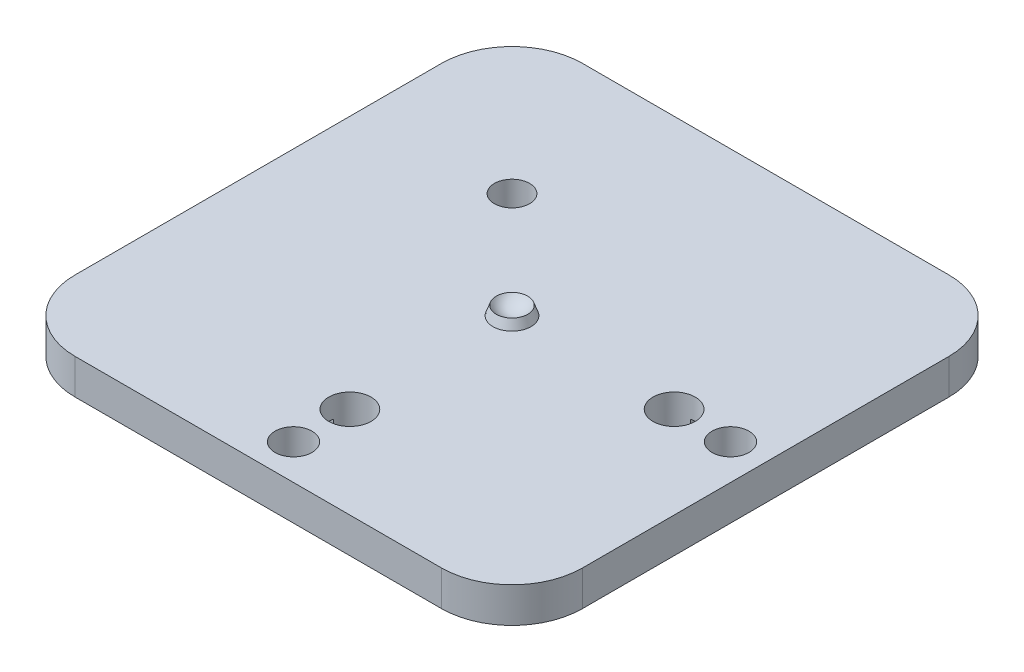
ISO-10303-21;
HEADER;
FILE_DESCRIPTION(('STEP AP214'),'2;1');
FILE_NAME('part.step','',(''),(''),'','','');
FILE_SCHEMA(('AUTOMOTIVE_DESIGN { 1 0 10303 214 1 1 1 1 }'));
ENDSEC;
DATA;
#1=APPLICATION_CONTEXT('core data for automotive mechanical design processes');
#2=APPLICATION_PROTOCOL_DEFINITION('international standard','automotive_design',2000,#1);
#3=PRODUCT_CONTEXT('',#1,'mechanical');
#4=PRODUCT('Part','Part','',(#3));
#5=PRODUCT_RELATED_PRODUCT_CATEGORY('part','',(#4));
#6=PRODUCT_DEFINITION_FORMATION('','',#4);
#7=PRODUCT_DEFINITION_CONTEXT('part definition',#1,'design');
#8=PRODUCT_DEFINITION('design','',#6,#7);
#9=PRODUCT_DEFINITION_SHAPE('','',#8);
#10=(LENGTH_UNIT() NAMED_UNIT(*) SI_UNIT(.MILLI.,.METRE.));
#11=(NAMED_UNIT(*) PLANE_ANGLE_UNIT() SI_UNIT($,.RADIAN.));
#12=(NAMED_UNIT(*) SI_UNIT($,.STERADIAN.) SOLID_ANGLE_UNIT());
#13=UNCERTAINTY_MEASURE_WITH_UNIT(LENGTH_MEASURE(1.E-05),#10,'distance_accuracy_value','');
#14=(GEOMETRIC_REPRESENTATION_CONTEXT(3) GLOBAL_UNCERTAINTY_ASSIGNED_CONTEXT((#13)) GLOBAL_UNIT_ASSIGNED_CONTEXT((#10,
#11,#12)) REPRESENTATION_CONTEXT('',''));
#15=CARTESIAN_POINT('',(0.,0.,0.));
#16=DIRECTION('',(0.,0.,1.));
#17=DIRECTION('',(1.,0.,0.));
#18=AXIS2_PLACEMENT_3D('',#15,#16,#17);
#19=CARTESIAN_POINT('',(0.,0.,0.));
#20=DIRECTION('',(0.,-1.,0.));
#21=DIRECTION('',(0.,0.,-1.));
#22=AXIS2_PLACEMENT_3D('',#19,#20,#21);
#23=CONICAL_SURFACE('',#22,2.7,0.349065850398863);
#24=CARTESIAN_POINT('',(0.,1.28250536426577,0.));
#25=DIRECTION('',(0.,1.,0.));
#26=DIRECTION('',(0.,0.,1.));
#27=AXIS2_PLACEMENT_3D('',#24,#25,#26);
#28=CIRCLE('',#27,2.23320622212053);
#29=CARTESIAN_POINT('',(0.,1.28250536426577,2.23320622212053));
#30=VERTEX_POINT('',#29);
#31=EDGE_CURVE('E421',#30,#30,#28,.T.);
#32=ORIENTED_EDGE('',*,*,#31,.F.);
#33=EDGE_LOOP('',(#32));
#34=FACE_BOUND('',#33,.T.);
#35=CARTESIAN_POINT('',(0.,0.,0.));
#36=DIRECTION('',(0.,1.,0.));
#37=DIRECTION('',(0.,0.,1.));
#38=AXIS2_PLACEMENT_3D('',#35,#36,#37);
#39=CIRCLE('',#38,2.7);
#40=CARTESIAN_POINT('',(0.,0.,2.7));
#41=VERTEX_POINT('',#40);
#42=EDGE_CURVE('E411',#41,#41,#39,.T.);
#43=ORIENTED_EDGE('',*,*,#42,.T.);
#44=EDGE_LOOP('',(#43));
#45=FACE_BOUND('',#44,.T.);
#46=ADVANCED_FACE('F41',(#34,#45),#23,.T.);
#47=CARTESIAN_POINT('',(0.,2.8,0.));
#48=DIRECTION('',(0.,1.,0.));
#49=DIRECTION('',(1.,0.,0.));
#50=AXIS2_PLACEMENT_3D('',#47,#48,#49);
#51=SPHERICAL_SURFACE('',#50,2.7);
#52=ORIENTED_EDGE('',*,*,#31,.T.);
#53=EDGE_LOOP('',(#52));
#54=FACE_BOUND('',#53,.T.);
#55=ADVANCED_FACE('F534',(#54),#51,.F.);
#56=CARTESIAN_POINT('',(0.,-5.,0.));
#57=DIRECTION('',(0.,1.,0.));
#58=DIRECTION('',(0.,0.,1.));
#59=AXIS2_PLACEMENT_3D('',#56,#57,#58);
#60=PLANE('',#59);
#61=DIRECTION('',(0.,0.,-1.));
#62=VECTOR('',#61,1.);
#63=CARTESIAN_POINT('',(-36.,-5.,-36.));
#64=LINE('',#63,#62);
#65=CARTESIAN_POINT('',(-36.,-5.,26.));
#66=VERTEX_POINT('',#65);
#67=CARTESIAN_POINT('',(-36.,-5.,-26.));
#68=VERTEX_POINT('',#67);
#69=EDGE_CURVE('E405',#66,#68,#64,.T.);
#70=ORIENTED_EDGE('',*,*,#69,.T.);
#71=CARTESIAN_POINT('',(-26.,-5.,-26.));
#72=DIRECTION('',(0.,1.,0.));
#73=DIRECTION('',(0.,0.,1.));
#74=AXIS2_PLACEMENT_3D('',#71,#72,#73);
#75=CIRCLE('',#74,10.);
#76=CARTESIAN_POINT('',(-26.,-5.,-36.));
#77=VERTEX_POINT('',#76);
#78=EDGE_CURVE('E486',#68,#77,#75,.F.);
#79=ORIENTED_EDGE('',*,*,#78,.T.);
#80=DIRECTION('',(1.,0.,0.));
#81=VECTOR('',#80,1.);
#82=CARTESIAN_POINT('',(-36.,-5.,-36.));
#83=LINE('',#82,#81);
#84=CARTESIAN_POINT('',(26.,-5.,-36.));
#85=VERTEX_POINT('',#84);
#86=EDGE_CURVE('E408',#77,#85,#83,.T.);
#87=ORIENTED_EDGE('',*,*,#86,.T.);
#88=CARTESIAN_POINT('',(26.,-5.,-26.));
#89=DIRECTION('',(0.,1.,0.));
#90=DIRECTION('',(0.,0.,1.));
#91=AXIS2_PLACEMENT_3D('',#88,#89,#90);
#92=CIRCLE('',#91,10.);
#93=CARTESIAN_POINT('',(36.,-5.,-26.));
#94=VERTEX_POINT('',#93);
#95=EDGE_CURVE('E484',#85,#94,#92,.F.);
#96=ORIENTED_EDGE('',*,*,#95,.T.);
#97=DIRECTION('',(0.,0.,1.));
#98=VECTOR('',#97,1.);
#99=CARTESIAN_POINT('',(36.,-5.,-36.));
#100=LINE('',#99,#98);
#101=CARTESIAN_POINT('',(36.,-5.,26.));
#102=VERTEX_POINT('',#101);
#103=EDGE_CURVE('E400',#94,#102,#100,.T.);
#104=ORIENTED_EDGE('',*,*,#103,.T.);
#105=CARTESIAN_POINT('',(26.,-5.,26.));
#106=DIRECTION('',(0.,1.,0.));
#107=DIRECTION('',(0.,0.,1.));
#108=AXIS2_PLACEMENT_3D('',#105,#106,#107);
#109=CIRCLE('',#108,10.);
#110=CARTESIAN_POINT('',(26.,-5.,36.));
#111=VERTEX_POINT('',#110);
#112=EDGE_CURVE('E61',#102,#111,#109,.F.);
#113=ORIENTED_EDGE('',*,*,#112,.T.);
#114=DIRECTION('',(-1.,0.,0.));
#115=VECTOR('',#114,1.);
#116=CARTESIAN_POINT('',(-36.,-5.,36.));
#117=LINE('',#116,#115);
#118=CARTESIAN_POINT('',(-26.,-5.,36.));
#119=VERTEX_POINT('',#118);
#120=EDGE_CURVE('E402',#111,#119,#117,.T.);
#121=ORIENTED_EDGE('',*,*,#120,.T.);
#122=CARTESIAN_POINT('',(-26.,-5.,26.));
#123=DIRECTION('',(0.,1.,0.));
#124=DIRECTION('',(0.,0.,1.));
#125=AXIS2_PLACEMENT_3D('',#122,#123,#124);
#126=CIRCLE('',#125,10.);
#127=EDGE_CURVE('E482',#119,#66,#126,.F.);
#128=ORIENTED_EDGE('',*,*,#127,.T.);
#129=EDGE_LOOP('',(#70,#79,#87,#96,#104,#113,#121,#128));
#130=FACE_BOUND('',#129,.T.);
#131=CARTESIAN_POINT('',(23.,-5.,0.));
#132=DIRECTION('',(0.,-1.,0.));
#133=DIRECTION('',(0.,0.,-1.));
#134=AXIS2_PLACEMENT_3D('',#131,#132,#133);
#135=CIRCLE('',#134,3.);
#136=CARTESIAN_POINT('',(22.4,-5.,2.93938769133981));
#137=VERTEX_POINT('',#136);
#138=CARTESIAN_POINT('',(22.4,-5.,-2.93938769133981));
#139=VERTEX_POINT('',#138);
#140=EDGE_CURVE('E396',#137,#139,#135,.T.);
#141=ORIENTED_EDGE('',*,*,#140,.F.);
#142=DIRECTION('',(0.,0.,-1.));
#143=VECTOR('',#142,1.);
#144=CARTESIAN_POINT('',(22.4,-5.,-5.3));
#145=LINE('',#144,#143);
#146=CARTESIAN_POINT('',(22.4,-5.,5.3));
#147=VERTEX_POINT('',#146);
#148=EDGE_CURVE('E287',#147,#137,#145,.T.);
#149=ORIENTED_EDGE('',*,*,#148,.F.);
#150=DIRECTION('',(-1.,0.,0.));
#151=VECTOR('',#150,1.);
#152=CARTESIAN_POINT('',(22.4,-5.,5.3));
#153=LINE('',#152,#151);
#154=CARTESIAN_POINT('',(23.6,-5.,5.3));
#155=VERTEX_POINT('',#154);
#156=EDGE_CURVE('E312',#155,#147,#153,.T.);
#157=ORIENTED_EDGE('',*,*,#156,.F.);
#158=DIRECTION('',(0.,0.,1.));
#159=VECTOR('',#158,1.);
#160=CARTESIAN_POINT('',(23.6,-5.,5.3));
#161=LINE('',#160,#159);
#162=CARTESIAN_POINT('',(23.6,-5.,2.93938769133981));
#163=VERTEX_POINT('',#162);
#164=EDGE_CURVE('E315',#163,#155,#161,.T.);
#165=ORIENTED_EDGE('',*,*,#164,.F.);
#166=CARTESIAN_POINT('',(23.6,-5.,-2.93938769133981));
#167=VERTEX_POINT('',#166);
#168=EDGE_CURVE('E392',#167,#163,#135,.T.);
#169=ORIENTED_EDGE('',*,*,#168,.F.);
#170=CARTESIAN_POINT('',(23.6,-5.,-5.3));
#171=VERTEX_POINT('',#170);
#172=EDGE_CURVE('E317',#171,#167,#161,.T.);
#173=ORIENTED_EDGE('',*,*,#172,.F.);
#174=DIRECTION('',(1.,0.,0.));
#175=VECTOR('',#174,1.);
#176=CARTESIAN_POINT('',(23.6,-5.,-5.3));
#177=LINE('',#176,#175);
#178=CARTESIAN_POINT('',(22.4,-5.,-5.3));
#179=VERTEX_POINT('',#178);
#180=EDGE_CURVE('E319',#179,#171,#177,.T.);
#181=ORIENTED_EDGE('',*,*,#180,.F.);
#182=EDGE_CURVE('E322',#139,#179,#145,.T.);
#183=ORIENTED_EDGE('',*,*,#182,.F.);
#184=EDGE_LOOP('',(#141,#149,#157,#165,#169,#173,#181,#183));
#185=FACE_BOUND('',#184,.T.);
#186=CARTESIAN_POINT('',(0.,-5.,23.));
#187=DIRECTION('',(0.,-1.,0.));
#188=DIRECTION('',(0.,0.,-1.));
#189=AXIS2_PLACEMENT_3D('',#186,#187,#188);
#190=CIRCLE('',#189,3.);
#191=CARTESIAN_POINT('',(2.93938769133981,-5.,23.6));
#192=VERTEX_POINT('',#191);
#193=CARTESIAN_POINT('',(-2.93938769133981,-5.,23.6));
#194=VERTEX_POINT('',#193);
#195=EDGE_CURVE('E388',#192,#194,#190,.T.);
#196=ORIENTED_EDGE('',*,*,#195,.F.);
#197=DIRECTION('',(-1.,0.,0.));
#198=VECTOR('',#197,1.);
#199=CARTESIAN_POINT('',(-5.3,-5.,23.6));
#200=LINE('',#199,#198);
#201=CARTESIAN_POINT('',(5.3,-5.,23.6));
#202=VERTEX_POINT('',#201);
#203=EDGE_CURVE('E277',#202,#192,#200,.T.);
#204=ORIENTED_EDGE('',*,*,#203,.F.);
#205=DIRECTION('',(0.,0.,1.));
#206=VECTOR('',#205,1.);
#207=CARTESIAN_POINT('',(5.3,-5.,23.6));
#208=LINE('',#207,#206);
#209=CARTESIAN_POINT('',(5.3,-5.,22.4));
#210=VERTEX_POINT('',#209);
#211=EDGE_CURVE('E290',#210,#202,#208,.T.);
#212=ORIENTED_EDGE('',*,*,#211,.F.);
#213=DIRECTION('',(1.,0.,0.));
#214=VECTOR('',#213,1.);
#215=CARTESIAN_POINT('',(5.3,-5.,22.4));
#216=LINE('',#215,#214);
#217=CARTESIAN_POINT('',(2.93938769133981,-5.,22.4));
#218=VERTEX_POINT('',#217);
#219=EDGE_CURVE('E286',#218,#210,#216,.T.);
#220=ORIENTED_EDGE('',*,*,#219,.F.);
#221=CARTESIAN_POINT('',(-2.93938769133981,-5.,22.4));
#222=VERTEX_POINT('',#221);
#223=EDGE_CURVE('E385',#222,#218,#190,.T.);
#224=ORIENTED_EDGE('',*,*,#223,.F.);
#225=CARTESIAN_POINT('',(-5.3,-5.,22.4));
#226=VERTEX_POINT('',#225);
#227=EDGE_CURVE('E288',#226,#222,#216,.T.);
#228=ORIENTED_EDGE('',*,*,#227,.F.);
#229=DIRECTION('',(0.,0.,-1.));
#230=VECTOR('',#229,1.);
#231=CARTESIAN_POINT('',(-5.3,-5.,22.4));
#232=LINE('',#231,#230);
#233=CARTESIAN_POINT('',(-5.3,-5.,23.6));
#234=VERTEX_POINT('',#233);
#235=EDGE_CURVE('E257',#234,#226,#232,.T.);
#236=ORIENTED_EDGE('',*,*,#235,.F.);
#237=EDGE_CURVE('E279',#194,#234,#200,.T.);
#238=ORIENTED_EDGE('',*,*,#237,.F.);
#239=EDGE_LOOP('',(#196,#204,#212,#220,#224,#228,#236,#238));
#240=FACE_BOUND('',#239,.T.);
#241=CARTESIAN_POINT('',(-15.,-5.,-15.));
#242=DIRECTION('',(0.,-1.,0.));
#243=DIRECTION('',(0.,0.,-1.));
#244=AXIS2_PLACEMENT_3D('',#241,#242,#243);
#245=CIRCLE('',#244,2.5);
#246=CARTESIAN_POINT('',(-12.859635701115,-5.,-16.2918361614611));
#247=VERTEX_POINT('',#246);
#248=CARTESIAN_POINT('',(-16.2918361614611,-5.,-12.859635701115));
#249=VERTEX_POINT('',#248);
#250=EDGE_CURVE('E382',#247,#249,#245,.T.);
#251=ORIENTED_EDGE('',*,*,#250,.F.);
#252=DIRECTION('',(-0.707106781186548,0.,0.707106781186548));
#253=VECTOR('',#252,1.);
#254=CARTESIAN_POINT('',(-18.3234018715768,-5.,-10.8280699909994));
#255=LINE('',#254,#253);
#256=CARTESIAN_POINT('',(-10.8280699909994,-5.,-18.3234018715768));
#257=VERTEX_POINT('',#256);
#258=EDGE_CURVE('E345',#257,#247,#255,.T.);
#259=ORIENTED_EDGE('',*,*,#258,.F.);
#260=DIRECTION('',(0.707106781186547,0.,0.707106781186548));
#261=VECTOR('',#260,1.);
#262=CARTESIAN_POINT('',(-10.8280699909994,-5.,-18.3234018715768));
#263=LINE('',#262,#261);
#264=CARTESIAN_POINT('',(-11.6765981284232,-5.,-19.1719300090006));
#265=VERTEX_POINT('',#264);
#266=EDGE_CURVE('E347',#265,#257,#263,.T.);
#267=ORIENTED_EDGE('',*,*,#266,.F.);
#268=DIRECTION('',(0.707106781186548,0.,-0.707106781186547));
#269=VECTOR('',#268,1.);
#270=CARTESIAN_POINT('',(-11.6765981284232,-5.,-19.1719300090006));
#271=LINE('',#270,#269);
#272=CARTESIAN_POINT('',(-13.7081638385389,-5.,-17.140364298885));
#273=VERTEX_POINT('',#272);
#274=EDGE_CURVE('E351',#273,#265,#271,.T.);
#275=ORIENTED_EDGE('',*,*,#274,.F.);
#276=CARTESIAN_POINT('',(-17.140364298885,-5.,-13.7081638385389));
#277=VERTEX_POINT('',#276);
#278=EDGE_CURVE('E379',#277,#273,#245,.T.);
#279=ORIENTED_EDGE('',*,*,#278,.F.);
#280=CARTESIAN_POINT('',(-19.1719300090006,-5.,-11.6765981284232));
#281=VERTEX_POINT('',#280);
#282=EDGE_CURVE('E352',#281,#277,#271,.T.);
#283=ORIENTED_EDGE('',*,*,#282,.F.);
#284=DIRECTION('',(-0.707106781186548,0.,-0.707106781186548));
#285=VECTOR('',#284,1.);
#286=CARTESIAN_POINT('',(-19.1719300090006,-5.,-11.6765981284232));
#287=LINE('',#286,#285);
#288=CARTESIAN_POINT('',(-18.3234018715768,-5.,-10.8280699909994));
#289=VERTEX_POINT('',#288);
#290=EDGE_CURVE('E311',#289,#281,#287,.T.);
#291=ORIENTED_EDGE('',*,*,#290,.F.);
#292=EDGE_CURVE('E348',#249,#289,#255,.T.);
#293=ORIENTED_EDGE('',*,*,#292,.F.);
#294=EDGE_LOOP('',(#251,#259,#267,#275,#279,#283,#291,#293));
#295=FACE_BOUND('',#294,.T.);
#296=CARTESIAN_POINT('',(0.,-5.,31.));
#297=DIRECTION('',(0.,-1.,0.));
#298=DIRECTION('',(0.,0.,-1.));
#299=AXIS2_PLACEMENT_3D('',#296,#297,#298);
#300=CIRCLE('',#299,2.625);
#301=CARTESIAN_POINT('',(0.,-5.,28.375));
#302=VERTEX_POINT('',#301);
#303=EDGE_CURVE('E373',#302,#302,#300,.T.);
#304=ORIENTED_EDGE('',*,*,#303,.F.);
#305=EDGE_LOOP('',(#304));
#306=FACE_BOUND('',#305,.T.);
#307=CARTESIAN_POINT('',(31.,-5.,0.));
#308=DIRECTION('',(0.,-1.,0.));
#309=DIRECTION('',(0.,0.,-1.));
#310=AXIS2_PLACEMENT_3D('',#307,#308,#309);
#311=CIRCLE('',#310,2.625);
#312=CARTESIAN_POINT('',(31.,-5.,-2.625));
#313=VERTEX_POINT('',#312);
#314=EDGE_CURVE('E367',#313,#313,#311,.T.);
#315=ORIENTED_EDGE('',*,*,#314,.F.);
#316=EDGE_LOOP('',(#315));
#317=FACE_BOUND('',#316,.T.);
#318=ADVANCED_FACE('F512',(#130,#185,#240,#295,#306,#317),#60,.F.);
#319=CARTESIAN_POINT('',(0.,0.,0.));
#320=DIRECTION('',(0.,1.,0.));
#321=DIRECTION('',(0.,0.,1.));
#322=AXIS2_PLACEMENT_3D('',#319,#320,#321);
#323=PLANE('',#322);
#324=ORIENTED_EDGE('',*,*,#42,.F.);
#325=EDGE_LOOP('',(#324));
#326=FACE_BOUND('',#325,.T.);
#327=CARTESIAN_POINT('',(0.,0.,31.));
#328=DIRECTION('',(0.,-1.,0.));
#329=DIRECTION('',(0.,0.,-1.));
#330=AXIS2_PLACEMENT_3D('',#327,#328,#329);
#331=CIRCLE('',#330,2.625);
#332=CARTESIAN_POINT('',(0.,0.,28.375));
#333=VERTEX_POINT('',#332);
#334=EDGE_CURVE('E370',#333,#333,#331,.T.);
#335=ORIENTED_EDGE('',*,*,#334,.T.);
#336=EDGE_LOOP('',(#335));
#337=FACE_BOUND('',#336,.T.);
#338=CARTESIAN_POINT('',(0.,0.,23.));
#339=DIRECTION('',(0.,-1.,0.));
#340=DIRECTION('',(0.,0.,-1.));
#341=AXIS2_PLACEMENT_3D('',#338,#339,#340);
#342=CIRCLE('',#341,3.);
#343=CARTESIAN_POINT('',(0.,0.,20.));
#344=VERTEX_POINT('',#343);
#345=EDGE_CURVE('E389',#344,#344,#342,.T.);
#346=ORIENTED_EDGE('',*,*,#345,.T.);
#347=EDGE_LOOP('',(#346));
#348=FACE_BOUND('',#347,.T.);
#349=DIRECTION('',(1.,0.,0.));
#350=VECTOR('',#349,1.);
#351=CARTESIAN_POINT('',(-36.,0.,-36.));
#352=LINE('',#351,#350);
#353=CARTESIAN_POINT('',(-26.,0.,-36.));
#354=VERTEX_POINT('',#353);
#355=CARTESIAN_POINT('',(26.,0.,-36.));
#356=VERTEX_POINT('',#355);
#357=EDGE_CURVE('E403',#354,#356,#352,.T.);
#358=ORIENTED_EDGE('',*,*,#357,.F.);
#359=CARTESIAN_POINT('',(-26.,0.,-26.));
#360=DIRECTION('',(0.,1.,0.));
#361=DIRECTION('',(0.,0.,1.));
#362=AXIS2_PLACEMENT_3D('',#359,#360,#361);
#363=CIRCLE('',#362,10.);
#364=CARTESIAN_POINT('',(-36.,0.,-26.));
#365=VERTEX_POINT('',#364);
#366=EDGE_CURVE('E474',#354,#365,#363,.T.);
#367=ORIENTED_EDGE('',*,*,#366,.T.);
#368=DIRECTION('',(0.,0.,-1.));
#369=VECTOR('',#368,1.);
#370=CARTESIAN_POINT('',(-36.,0.,-36.));
#371=LINE('',#370,#369);
#372=CARTESIAN_POINT('',(-36.,0.,26.));
#373=VERTEX_POINT('',#372);
#374=EDGE_CURVE('E416',#373,#365,#371,.T.);
#375=ORIENTED_EDGE('',*,*,#374,.F.);
#376=CARTESIAN_POINT('',(-26.,0.,26.));
#377=DIRECTION('',(0.,1.,0.));
#378=DIRECTION('',(0.,0.,1.));
#379=AXIS2_PLACEMENT_3D('',#376,#377,#378);
#380=CIRCLE('',#379,10.);
#381=CARTESIAN_POINT('',(-26.,0.,36.));
#382=VERTEX_POINT('',#381);
#383=EDGE_CURVE('E470',#373,#382,#380,.T.);
#384=ORIENTED_EDGE('',*,*,#383,.T.);
#385=DIRECTION('',(-1.,0.,0.));
#386=VECTOR('',#385,1.);
#387=CARTESIAN_POINT('',(-36.,0.,36.));
#388=LINE('',#387,#386);
#389=CARTESIAN_POINT('',(26.,0.,36.));
#390=VERTEX_POINT('',#389);
#391=EDGE_CURVE('E414',#390,#382,#388,.T.);
#392=ORIENTED_EDGE('',*,*,#391,.F.);
#393=CARTESIAN_POINT('',(26.,0.,26.));
#394=DIRECTION('',(0.,1.,0.));
#395=DIRECTION('',(0.,0.,1.));
#396=AXIS2_PLACEMENT_3D('',#393,#394,#395);
#397=CIRCLE('',#396,10.);
#398=CARTESIAN_POINT('',(36.,0.,26.));
#399=VERTEX_POINT('',#398);
#400=EDGE_CURVE('E468',#390,#399,#397,.T.);
#401=ORIENTED_EDGE('',*,*,#400,.T.);
#402=DIRECTION('',(0.,0.,1.));
#403=VECTOR('',#402,1.);
#404=CARTESIAN_POINT('',(36.,0.,-36.));
#405=LINE('',#404,#403);
#406=CARTESIAN_POINT('',(36.,0.,-26.));
#407=VERTEX_POINT('',#406);
#408=EDGE_CURVE('E395',#407,#399,#405,.T.);
#409=ORIENTED_EDGE('',*,*,#408,.F.);
#410=CARTESIAN_POINT('',(26.,0.,-26.));
#411=DIRECTION('',(0.,1.,0.));
#412=DIRECTION('',(0.,0.,1.));
#413=AXIS2_PLACEMENT_3D('',#410,#411,#412);
#414=CIRCLE('',#413,10.);
#415=EDGE_CURVE('E472',#407,#356,#414,.T.);
#416=ORIENTED_EDGE('',*,*,#415,.T.);
#417=EDGE_LOOP('',(#358,#367,#375,#384,#392,#401,#409,#416));
#418=FACE_BOUND('',#417,.T.);
#419=CARTESIAN_POINT('',(23.,0.,0.));
#420=DIRECTION('',(0.,-1.,0.));
#421=DIRECTION('',(0.,0.,-1.));
#422=AXIS2_PLACEMENT_3D('',#419,#420,#421);
#423=CIRCLE('',#422,3.);
#424=CARTESIAN_POINT('',(23.,0.,-3.));
#425=VERTEX_POINT('',#424);
#426=EDGE_CURVE('E397',#425,#425,#423,.T.);
#427=ORIENTED_EDGE('',*,*,#426,.T.);
#428=EDGE_LOOP('',(#427));
#429=FACE_BOUND('',#428,.T.);
#430=CARTESIAN_POINT('',(-15.,0.,-15.));
#431=DIRECTION('',(0.,-1.,0.));
#432=DIRECTION('',(0.,0.,-1.));
#433=AXIS2_PLACEMENT_3D('',#430,#431,#432);
#434=CIRCLE('',#433,2.5);
#435=CARTESIAN_POINT('',(-15.,0.,-17.5));
#436=VERTEX_POINT('',#435);
#437=EDGE_CURVE('E376',#436,#436,#434,.T.);
#438=ORIENTED_EDGE('',*,*,#437,.T.);
#439=EDGE_LOOP('',(#438));
#440=FACE_BOUND('',#439,.T.);
#441=CARTESIAN_POINT('',(31.,0.,0.));
#442=DIRECTION('',(0.,-1.,0.));
#443=DIRECTION('',(0.,0.,-1.));
#444=AXIS2_PLACEMENT_3D('',#441,#442,#443);
#445=CIRCLE('',#444,2.625);
#446=CARTESIAN_POINT('',(31.,0.,-2.625));
#447=VERTEX_POINT('',#446);
#448=EDGE_CURVE('E295',#447,#447,#445,.T.);
#449=ORIENTED_EDGE('',*,*,#448,.T.);
#450=EDGE_LOOP('',(#449));
#451=FACE_BOUND('',#450,.T.);
#452=ADVANCED_FACE('F499',(#326,#337,#348,#418,#429,#440,#451),#323,.T.);
#453=CARTESIAN_POINT('',(36.,-5.,-36.));
#454=DIRECTION('',(-1.,0.,0.));
#455=DIRECTION('',(0.,0.,1.));
#456=AXIS2_PLACEMENT_3D('',#453,#454,#455);
#457=PLANE('',#456);
#458=ORIENTED_EDGE('',*,*,#103,.F.);
#459=DIRECTION('',(0.,1.,0.));
#460=VECTOR('',#459,1.);
#461=CARTESIAN_POINT('',(36.,-5.,-26.));
#462=LINE('',#461,#460);
#463=EDGE_CURVE('E490',#94,#407,#462,.T.);
#464=ORIENTED_EDGE('',*,*,#463,.T.);
#465=ORIENTED_EDGE('',*,*,#408,.T.);
#466=DIRECTION('',(0.,1.,0.));
#467=VECTOR('',#466,1.);
#468=CARTESIAN_POINT('',(36.,-5.,26.));
#469=LINE('',#468,#467);
#470=EDGE_CURVE('E488',#399,#102,#469,.F.);
#471=ORIENTED_EDGE('',*,*,#470,.T.);
#472=EDGE_LOOP('',(#458,#464,#465,#471));
#473=FACE_BOUND('',#472,.T.);
#474=ADVANCED_FACE('F527',(#473),#457,.F.);
#475=CARTESIAN_POINT('',(-36.,-5.,36.));
#476=DIRECTION('',(0.,0.,-1.));
#477=DIRECTION('',(-1.,0.,0.));
#478=AXIS2_PLACEMENT_3D('',#475,#476,#477);
#479=PLANE('',#478);
#480=ORIENTED_EDGE('',*,*,#391,.T.);
#481=DIRECTION('',(0.,1.,0.));
#482=VECTOR('',#481,1.);
#483=CARTESIAN_POINT('',(-26.,-5.,36.));
#484=LINE('',#483,#482);
#485=EDGE_CURVE('E11',#382,#119,#484,.F.);
#486=ORIENTED_EDGE('',*,*,#485,.T.);
#487=ORIENTED_EDGE('',*,*,#120,.F.);
#488=DIRECTION('',(0.,1.,0.));
#489=VECTOR('',#488,1.);
#490=CARTESIAN_POINT('',(26.,-5.,36.));
#491=LINE('',#490,#489);
#492=EDGE_CURVE('E49',#111,#390,#491,.T.);
#493=ORIENTED_EDGE('',*,*,#492,.T.);
#494=EDGE_LOOP('',(#480,#486,#487,#493));
#495=FACE_BOUND('',#494,.T.);
#496=ADVANCED_FACE('F495',(#495),#479,.F.);
#497=CARTESIAN_POINT('',(-36.,-5.,-36.));
#498=DIRECTION('',(1.,0.,0.));
#499=DIRECTION('',(0.,0.,-1.));
#500=AXIS2_PLACEMENT_3D('',#497,#498,#499);
#501=PLANE('',#500);
#502=ORIENTED_EDGE('',*,*,#374,.T.);
#503=DIRECTION('',(0.,1.,0.));
#504=VECTOR('',#503,1.);
#505=CARTESIAN_POINT('',(-36.,-5.,-26.));
#506=LINE('',#505,#504);
#507=EDGE_CURVE('E479',#365,#68,#506,.F.);
#508=ORIENTED_EDGE('',*,*,#507,.T.);
#509=ORIENTED_EDGE('',*,*,#69,.F.);
#510=DIRECTION('',(0.,1.,0.));
#511=VECTOR('',#510,1.);
#512=CARTESIAN_POINT('',(-36.,-5.,26.));
#513=LINE('',#512,#511);
#514=EDGE_CURVE('E476',#66,#373,#513,.T.);
#515=ORIENTED_EDGE('',*,*,#514,.T.);
#516=EDGE_LOOP('',(#502,#508,#509,#515));
#517=FACE_BOUND('',#516,.T.);
#518=ADVANCED_FACE('F509',(#517),#501,.F.);
#519=CARTESIAN_POINT('',(-36.,-5.,-36.));
#520=DIRECTION('',(0.,0.,1.));
#521=DIRECTION('',(1.,0.,0.));
#522=AXIS2_PLACEMENT_3D('',#519,#520,#521);
#523=PLANE('',#522);
#524=ORIENTED_EDGE('',*,*,#86,.F.);
#525=DIRECTION('',(0.,1.,0.));
#526=VECTOR('',#525,1.);
#527=CARTESIAN_POINT('',(-26.,-5.,-36.));
#528=LINE('',#527,#526);
#529=EDGE_CURVE('E465',#77,#354,#528,.T.);
#530=ORIENTED_EDGE('',*,*,#529,.T.);
#531=ORIENTED_EDGE('',*,*,#357,.T.);
#532=DIRECTION('',(0.,1.,0.));
#533=VECTOR('',#532,1.);
#534=CARTESIAN_POINT('',(26.,-5.,-36.));
#535=LINE('',#534,#533);
#536=EDGE_CURVE('E463',#356,#85,#535,.F.);
#537=ORIENTED_EDGE('',*,*,#536,.T.);
#538=EDGE_LOOP('',(#524,#530,#531,#537));
#539=FACE_BOUND('',#538,.T.);
#540=ADVANCED_FACE('F519',(#539),#523,.F.);
#541=CARTESIAN_POINT('',(23.,-5.,0.));
#542=DIRECTION('',(0.,1.,0.));
#543=DIRECTION('',(0.,0.,1.));
#544=AXIS2_PLACEMENT_3D('',#541,#542,#543);
#545=CYLINDRICAL_SURFACE('',#544,3.);
#546=DIRECTION('',(0.,1.,0.));
#547=VECTOR('',#546,1.);
#548=CARTESIAN_POINT('',(22.4,-5.,-2.93938769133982));
#549=LINE('',#548,#547);
#550=CARTESIAN_POINT('',(22.4,-3.,-2.93938769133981));
#551=VERTEX_POINT('',#550);
#552=EDGE_CURVE('E461',#551,#139,#549,.F.);
#553=ORIENTED_EDGE('',*,*,#552,.F.);
#554=CARTESIAN_POINT('',(23.,-3.,0.));
#555=DIRECTION('',(0.,1.,0.));
#556=DIRECTION('',(0.,0.,1.));
#557=AXIS2_PLACEMENT_3D('',#554,#555,#556);
#558=CIRCLE('',#557,3.);
#559=CARTESIAN_POINT('',(23.6,-3.,-2.93938769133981));
#560=VERTEX_POINT('',#559);
#561=EDGE_CURVE('E453',#560,#551,#558,.T.);
#562=ORIENTED_EDGE('',*,*,#561,.F.);
#563=DIRECTION('',(0.,1.,0.));
#564=VECTOR('',#563,1.);
#565=CARTESIAN_POINT('',(23.6,-5.,-2.93938769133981));
#566=LINE('',#565,#564);
#567=EDGE_CURVE('E458',#167,#560,#566,.T.);
#568=ORIENTED_EDGE('',*,*,#567,.F.);
#569=ORIENTED_EDGE('',*,*,#168,.T.);
#570=DIRECTION('',(0.,1.,0.));
#571=VECTOR('',#570,1.);
#572=CARTESIAN_POINT('',(23.6,-5.,2.93938769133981));
#573=LINE('',#572,#571);
#574=CARTESIAN_POINT('',(23.6,-3.,2.93938769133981));
#575=VERTEX_POINT('',#574);
#576=EDGE_CURVE('E452',#575,#163,#573,.F.);
#577=ORIENTED_EDGE('',*,*,#576,.F.);
#578=CARTESIAN_POINT('',(22.4,-3.,2.93938769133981));
#579=VERTEX_POINT('',#578);
#580=EDGE_CURVE('E450',#579,#575,#558,.T.);
#581=ORIENTED_EDGE('',*,*,#580,.F.);
#582=DIRECTION('',(0.,1.,0.));
#583=VECTOR('',#582,1.);
#584=CARTESIAN_POINT('',(22.4,-5.,2.93938769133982));
#585=LINE('',#584,#583);
#586=EDGE_CURVE('E455',#137,#579,#585,.T.);
#587=ORIENTED_EDGE('',*,*,#586,.F.);
#588=ORIENTED_EDGE('',*,*,#140,.T.);
#589=EDGE_LOOP('',(#553,#562,#568,#569,#577,#581,#587,#588));
#590=FACE_BOUND('',#589,.T.);
#591=ORIENTED_EDGE('',*,*,#426,.F.);
#592=EDGE_LOOP('',(#591));
#593=FACE_BOUND('',#592,.T.);
#594=ADVANCED_FACE('F806',(#590,#593),#545,.F.);
#595=CARTESIAN_POINT('',(0.,-5.,23.));
#596=DIRECTION('',(0.,1.,0.));
#597=DIRECTION('',(0.,0.,1.));
#598=AXIS2_PLACEMENT_3D('',#595,#596,#597);
#599=CYLINDRICAL_SURFACE('',#598,3.);
#600=DIRECTION('',(0.,1.,0.));
#601=VECTOR('',#600,1.);
#602=CARTESIAN_POINT('',(2.93938769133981,-5.,23.6));
#603=LINE('',#602,#601);
#604=CARTESIAN_POINT('',(2.93938769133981,-3.,23.6));
#605=VERTEX_POINT('',#604);
#606=EDGE_CURVE('E447',#192,#605,#603,.T.);
#607=ORIENTED_EDGE('',*,*,#606,.F.);
#608=ORIENTED_EDGE('',*,*,#195,.T.);
#609=DIRECTION('',(0.,1.,0.));
#610=VECTOR('',#609,1.);
#611=CARTESIAN_POINT('',(-2.93938769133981,-5.,23.6));
#612=LINE('',#611,#610);
#613=CARTESIAN_POINT('',(-2.93938769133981,-3.,23.6));
#614=VERTEX_POINT('',#613);
#615=EDGE_CURVE('E443',#614,#194,#612,.F.);
#616=ORIENTED_EDGE('',*,*,#615,.F.);
#617=CARTESIAN_POINT('',(0.,-3.,23.));
#618=DIRECTION('',(0.,1.,0.));
#619=DIRECTION('',(0.,0.,1.));
#620=AXIS2_PLACEMENT_3D('',#617,#618,#619);
#621=CIRCLE('',#620,3.);
#622=CARTESIAN_POINT('',(-2.93938769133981,-3.,22.4));
#623=VERTEX_POINT('',#622);
#624=EDGE_CURVE('E439',#623,#614,#621,.T.);
#625=ORIENTED_EDGE('',*,*,#624,.F.);
#626=DIRECTION('',(0.,1.,0.));
#627=VECTOR('',#626,1.);
#628=CARTESIAN_POINT('',(-2.93938769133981,-5.,22.4));
#629=LINE('',#628,#627);
#630=EDGE_CURVE('E267',#222,#623,#629,.T.);
#631=ORIENTED_EDGE('',*,*,#630,.F.);
#632=ORIENTED_EDGE('',*,*,#223,.T.);
#633=DIRECTION('',(0.,1.,0.));
#634=VECTOR('',#633,1.);
#635=CARTESIAN_POINT('',(2.93938769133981,-5.,22.4));
#636=LINE('',#635,#634);
#637=CARTESIAN_POINT('',(2.93938769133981,-3.,22.4));
#638=VERTEX_POINT('',#637);
#639=EDGE_CURVE('E445',#638,#218,#636,.F.);
#640=ORIENTED_EDGE('',*,*,#639,.F.);
#641=EDGE_CURVE('E441',#605,#638,#621,.T.);
#642=ORIENTED_EDGE('',*,*,#641,.F.);
#643=EDGE_LOOP('',(#607,#608,#616,#625,#631,#632,#640,#642));
#644=FACE_BOUND('',#643,.T.);
#645=ORIENTED_EDGE('',*,*,#345,.F.);
#646=EDGE_LOOP('',(#645));
#647=FACE_BOUND('',#646,.T.);
#648=ADVANCED_FACE('F797',(#644,#647),#599,.F.);
#649=CARTESIAN_POINT('',(-15.,-5.,-15.));
#650=DIRECTION('',(0.,1.,0.));
#651=DIRECTION('',(0.,0.,1.));
#652=AXIS2_PLACEMENT_3D('',#649,#650,#651);
#653=CYLINDRICAL_SURFACE('',#652,2.5);
#654=DIRECTION('',(0.,1.,0.));
#655=VECTOR('',#654,1.);
#656=CARTESIAN_POINT('',(-12.859635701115,-5.,-16.2918361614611));
#657=LINE('',#656,#655);
#658=CARTESIAN_POINT('',(-12.859635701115,-3.,-16.2918361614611));
#659=VERTEX_POINT('',#658);
#660=EDGE_CURVE('E436',#247,#659,#657,.T.);
#661=ORIENTED_EDGE('',*,*,#660,.F.);
#662=ORIENTED_EDGE('',*,*,#250,.T.);
#663=DIRECTION('',(0.,1.,0.));
#664=VECTOR('',#663,1.);
#665=CARTESIAN_POINT('',(-16.2918361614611,-5.,-12.859635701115));
#666=LINE('',#665,#664);
#667=CARTESIAN_POINT('',(-16.2918361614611,-3.,-12.859635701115));
#668=VERTEX_POINT('',#667);
#669=EDGE_CURVE('E432',#668,#249,#666,.F.);
#670=ORIENTED_EDGE('',*,*,#669,.F.);
#671=CARTESIAN_POINT('',(-15.,-3.,-15.));
#672=DIRECTION('',(0.,1.,0.));
#673=DIRECTION('',(0.,0.,1.));
#674=AXIS2_PLACEMENT_3D('',#671,#672,#673);
#675=CIRCLE('',#674,2.5);
#676=CARTESIAN_POINT('',(-17.140364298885,-3.,-13.7081638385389));
#677=VERTEX_POINT('',#676);
#678=EDGE_CURVE('E424',#677,#668,#675,.T.);
#679=ORIENTED_EDGE('',*,*,#678,.F.);
#680=DIRECTION('',(0.,1.,0.));
#681=VECTOR('',#680,1.);
#682=CARTESIAN_POINT('',(-17.140364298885,-5.,-13.7081638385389));
#683=LINE('',#682,#681);
#684=EDGE_CURVE('E428',#277,#677,#683,.T.);
#685=ORIENTED_EDGE('',*,*,#684,.F.);
#686=ORIENTED_EDGE('',*,*,#278,.T.);
#687=DIRECTION('',(0.,1.,0.));
#688=VECTOR('',#687,1.);
#689=CARTESIAN_POINT('',(-13.7081638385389,-5.,-17.140364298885));
#690=LINE('',#689,#688);
#691=CARTESIAN_POINT('',(-13.7081638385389,-3.,-17.140364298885));
#692=VERTEX_POINT('',#691);
#693=EDGE_CURVE('E434',#692,#273,#690,.F.);
#694=ORIENTED_EDGE('',*,*,#693,.F.);
#695=EDGE_CURVE('E429',#659,#692,#675,.T.);
#696=ORIENTED_EDGE('',*,*,#695,.F.);
#697=EDGE_LOOP('',(#661,#662,#670,#679,#685,#686,#694,#696));
#698=FACE_BOUND('',#697,.T.);
#699=ORIENTED_EDGE('',*,*,#437,.F.);
#700=EDGE_LOOP('',(#699));
#701=FACE_BOUND('',#700,.T.);
#702=ADVANCED_FACE('F788',(#698,#701),#653,.F.);
#703=CARTESIAN_POINT('',(0.,-5.,31.));
#704=DIRECTION('',(0.,1.,0.));
#705=DIRECTION('',(0.,0.,1.));
#706=AXIS2_PLACEMENT_3D('',#703,#704,#705);
#707=CYLINDRICAL_SURFACE('',#706,2.625);
#708=ORIENTED_EDGE('',*,*,#303,.T.);
#709=EDGE_LOOP('',(#708));
#710=FACE_BOUND('',#709,.T.);
#711=ORIENTED_EDGE('',*,*,#334,.F.);
#712=EDGE_LOOP('',(#711));
#713=FACE_BOUND('',#712,.T.);
#714=ADVANCED_FACE('F779',(#710,#713),#707,.F.);
#715=CARTESIAN_POINT('',(31.,-5.,0.));
#716=DIRECTION('',(0.,1.,0.));
#717=DIRECTION('',(0.,0.,1.));
#718=AXIS2_PLACEMENT_3D('',#715,#716,#717);
#719=CYLINDRICAL_SURFACE('',#718,2.625);
#720=ORIENTED_EDGE('',*,*,#314,.T.);
#721=EDGE_LOOP('',(#720));
#722=FACE_BOUND('',#721,.T.);
#723=ORIENTED_EDGE('',*,*,#448,.F.);
#724=EDGE_LOOP('',(#723));
#725=FACE_BOUND('',#724,.T.);
#726=ADVANCED_FACE('F771',(#722,#725),#719,.F.);
#727=CARTESIAN_POINT('',(0.,-3.,0.));
#728=DIRECTION('',(0.,1.,0.));
#729=DIRECTION('',(0.,0.,1.));
#730=AXIS2_PLACEMENT_3D('',#727,#728,#729);
#731=PLANE('',#730);
#732=ORIENTED_EDGE('',*,*,#678,.T.);
#733=DIRECTION('',(-0.707106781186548,0.,0.707106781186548));
#734=VECTOR('',#733,1.);
#735=CARTESIAN_POINT('',(-18.3234018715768,-3.,-10.8280699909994));
#736=LINE('',#735,#734);
#737=CARTESIAN_POINT('',(-18.3234018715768,-3.,-10.8280699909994));
#738=VERTEX_POINT('',#737);
#739=EDGE_CURVE('E336',#668,#738,#736,.T.);
#740=ORIENTED_EDGE('',*,*,#739,.T.);
#741=DIRECTION('',(-0.707106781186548,0.,-0.707106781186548));
#742=VECTOR('',#741,1.);
#743=CARTESIAN_POINT('',(-19.1719300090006,-3.,-11.6765981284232));
#744=LINE('',#743,#742);
#745=CARTESIAN_POINT('',(-19.1719300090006,-3.,-11.6765981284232));
#746=VERTEX_POINT('',#745);
#747=EDGE_CURVE('E364',#738,#746,#744,.T.);
#748=ORIENTED_EDGE('',*,*,#747,.T.);
#749=DIRECTION('',(0.707106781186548,0.,-0.707106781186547));
#750=VECTOR('',#749,1.);
#751=CARTESIAN_POINT('',(-11.6765981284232,-3.,-19.1719300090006));
#752=LINE('',#751,#750);
#753=EDGE_CURVE('E362',#746,#677,#752,.T.);
#754=ORIENTED_EDGE('',*,*,#753,.T.);
#755=EDGE_LOOP('',(#732,#740,#748,#754));
#756=FACE_BOUND('',#755,.T.);
#757=ADVANCED_FACE('F732',(#756),#731,.F.);
#758=CARTESIAN_POINT('',(-11.6765981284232,-3.,-19.1719300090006));
#759=DIRECTION('',(-0.707106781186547,0.,-0.707106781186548));
#760=DIRECTION('',(-0.707106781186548,0.,0.707106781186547));
#761=AXIS2_PLACEMENT_3D('',#758,#759,#760);
#762=PLANE('',#761);
#763=ORIENTED_EDGE('',*,*,#684,.T.);
#764=ORIENTED_EDGE('',*,*,#753,.F.);
#765=DIRECTION('',(0.,-1.,0.));
#766=VECTOR('',#765,1.);
#767=CARTESIAN_POINT('',(-19.1719300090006,-3.,-11.6765981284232));
#768=LINE('',#767,#766);
#769=EDGE_CURVE('E334',#746,#281,#768,.T.);
#770=ORIENTED_EDGE('',*,*,#769,.T.);
#771=ORIENTED_EDGE('',*,*,#282,.T.);
#772=EDGE_LOOP('',(#763,#764,#770,#771));
#773=FACE_BOUND('',#772,.T.);
#774=ADVANCED_FACE('F713',(#773),#762,.F.);
#775=CARTESIAN_POINT('',(-18.3234018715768,-3.,-10.8280699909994));
#776=DIRECTION('',(0.707106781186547,0.,0.707106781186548));
#777=DIRECTION('',(0.707106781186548,0.,-0.707106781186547));
#778=AXIS2_PLACEMENT_3D('',#775,#776,#777);
#779=PLANE('',#778);
#780=ORIENTED_EDGE('',*,*,#669,.T.);
#781=ORIENTED_EDGE('',*,*,#292,.T.);
#782=DIRECTION('',(0.,-1.,0.));
#783=VECTOR('',#782,1.);
#784=CARTESIAN_POINT('',(-18.3234018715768,-3.,-10.8280699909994));
#785=LINE('',#784,#783);
#786=EDGE_CURVE('E342',#738,#289,#785,.T.);
#787=ORIENTED_EDGE('',*,*,#786,.F.);
#788=ORIENTED_EDGE('',*,*,#739,.F.);
#789=EDGE_LOOP('',(#780,#781,#787,#788));
#790=FACE_BOUND('',#789,.T.);
#791=ADVANCED_FACE('F742',(#790),#779,.F.);
#792=CARTESIAN_POINT('',(-19.1719300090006,-3.,-11.6765981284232));
#793=DIRECTION('',(-0.707106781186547,0.,0.707106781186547));
#794=DIRECTION('',(0.707106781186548,0.,0.707106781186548));
#795=AXIS2_PLACEMENT_3D('',#792,#793,#794);
#796=PLANE('',#795);
#797=ORIENTED_EDGE('',*,*,#290,.T.);
#798=ORIENTED_EDGE('',*,*,#769,.F.);
#799=ORIENTED_EDGE('',*,*,#747,.F.);
#800=ORIENTED_EDGE('',*,*,#786,.T.);
#801=EDGE_LOOP('',(#797,#798,#799,#800));
#802=FACE_BOUND('',#801,.T.);
#803=ADVANCED_FACE('F739',(#802),#796,.F.);
#804=ORIENTED_EDGE('',*,*,#660,.T.);
#805=CARTESIAN_POINT('',(-10.8280699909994,-3.,-18.3234018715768));
#806=VERTEX_POINT('',#805);
#807=EDGE_CURVE('E356',#806,#659,#736,.T.);
#808=ORIENTED_EDGE('',*,*,#807,.F.);
#809=DIRECTION('',(0.,-1.,0.));
#810=VECTOR('',#809,1.);
#811=CARTESIAN_POINT('',(-10.8280699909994,-3.,-18.3234018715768));
#812=LINE('',#811,#810);
#813=EDGE_CURVE('E340',#806,#257,#812,.T.);
#814=ORIENTED_EDGE('',*,*,#813,.T.);
#815=ORIENTED_EDGE('',*,*,#258,.T.);
#816=EDGE_LOOP('',(#804,#808,#814,#815));
#817=FACE_BOUND('',#816,.T.);
#818=ADVANCED_FACE('F729',(#817),#779,.F.);
#819=ORIENTED_EDGE('',*,*,#695,.T.);
#820=CARTESIAN_POINT('',(-11.6765981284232,-3.,-19.1719300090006));
#821=VERTEX_POINT('',#820);
#822=EDGE_CURVE('E361',#692,#821,#752,.T.);
#823=ORIENTED_EDGE('',*,*,#822,.T.);
#824=DIRECTION('',(0.707106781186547,0.,0.707106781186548));
#825=VECTOR('',#824,1.);
#826=CARTESIAN_POINT('',(-10.8280699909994,-3.,-18.3234018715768));
#827=LINE('',#826,#825);
#828=EDGE_CURVE('E358',#821,#806,#827,.T.);
#829=ORIENTED_EDGE('',*,*,#828,.T.);
#830=ORIENTED_EDGE('',*,*,#807,.T.);
#831=EDGE_LOOP('',(#819,#823,#829,#830));
#832=FACE_BOUND('',#831,.T.);
#833=ADVANCED_FACE('F720',(#832),#731,.F.);
#834=CARTESIAN_POINT('',(-10.8280699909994,-3.,-18.3234018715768));
#835=DIRECTION('',(0.707106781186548,0.,-0.707106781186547));
#836=DIRECTION('',(-0.707106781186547,0.,-0.707106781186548));
#837=AXIS2_PLACEMENT_3D('',#834,#835,#836);
#838=PLANE('',#837);
#839=ORIENTED_EDGE('',*,*,#266,.T.);
#840=ORIENTED_EDGE('',*,*,#813,.F.);
#841=ORIENTED_EDGE('',*,*,#828,.F.);
#842=DIRECTION('',(0.,-1.,0.));
#843=VECTOR('',#842,1.);
#844=CARTESIAN_POINT('',(-11.6765981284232,-3.,-19.1719300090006));
#845=LINE('',#844,#843);
#846=EDGE_CURVE('E337',#821,#265,#845,.T.);
#847=ORIENTED_EDGE('',*,*,#846,.T.);
#848=EDGE_LOOP('',(#839,#840,#841,#847));
#849=FACE_BOUND('',#848,.T.);
#850=ADVANCED_FACE('F710',(#849),#838,.F.);
#851=ORIENTED_EDGE('',*,*,#693,.T.);
#852=ORIENTED_EDGE('',*,*,#274,.T.);
#853=ORIENTED_EDGE('',*,*,#846,.F.);
#854=ORIENTED_EDGE('',*,*,#822,.F.);
#855=EDGE_LOOP('',(#851,#852,#853,#854));
#856=FACE_BOUND('',#855,.T.);
#857=ADVANCED_FACE('F703',(#856),#762,.F.);
#858=CARTESIAN_POINT('',(0.,-3.,0.));
#859=DIRECTION('',(0.,1.,0.));
#860=DIRECTION('',(0.,0.,1.));
#861=AXIS2_PLACEMENT_3D('',#858,#859,#860);
#862=PLANE('',#861);
#863=ORIENTED_EDGE('',*,*,#624,.T.);
#864=DIRECTION('',(-1.,0.,0.));
#865=VECTOR('',#864,1.);
#866=CARTESIAN_POINT('',(-5.3,-3.,23.6));
#867=LINE('',#866,#865);
#868=CARTESIAN_POINT('',(-5.3,-3.,23.6));
#869=VERTEX_POINT('',#868);
#870=EDGE_CURVE('E275',#614,#869,#867,.T.);
#871=ORIENTED_EDGE('',*,*,#870,.T.);
#872=DIRECTION('',(0.,0.,-1.));
#873=VECTOR('',#872,1.);
#874=CARTESIAN_POINT('',(-5.3,-3.,22.4));
#875=LINE('',#874,#873);
#876=CARTESIAN_POINT('',(-5.3,-3.,22.4));
#877=VERTEX_POINT('',#876);
#878=EDGE_CURVE('E255',#869,#877,#875,.T.);
#879=ORIENTED_EDGE('',*,*,#878,.T.);
#880=DIRECTION('',(1.,0.,0.));
#881=VECTOR('',#880,1.);
#882=CARTESIAN_POINT('',(5.3,-3.,22.4));
#883=LINE('',#882,#881);
#884=EDGE_CURVE('E264',#877,#623,#883,.T.);
#885=ORIENTED_EDGE('',*,*,#884,.T.);
#886=EDGE_LOOP('',(#863,#871,#879,#885));
#887=FACE_BOUND('',#886,.T.);
#888=ADVANCED_FACE('F273',(#887),#862,.F.);
#889=CARTESIAN_POINT('',(5.3,-3.,22.4));
#890=DIRECTION('',(0.,0.,-1.));
#891=DIRECTION('',(-1.,0.,0.));
#892=AXIS2_PLACEMENT_3D('',#889,#890,#891);
#893=PLANE('',#892);
#894=ORIENTED_EDGE('',*,*,#630,.T.);
#895=ORIENTED_EDGE('',*,*,#884,.F.);
#896=DIRECTION('',(0.,-1.,0.));
#897=VECTOR('',#896,1.);
#898=CARTESIAN_POINT('',(-5.3,-3.,22.4));
#899=LINE('',#898,#897);
#900=EDGE_CURVE('E250',#877,#226,#899,.T.);
#901=ORIENTED_EDGE('',*,*,#900,.T.);
#902=ORIENTED_EDGE('',*,*,#227,.T.);
#903=EDGE_LOOP('',(#894,#895,#901,#902));
#904=FACE_BOUND('',#903,.T.);
#905=ADVANCED_FACE('F265',(#904),#893,.F.);
#906=CARTESIAN_POINT('',(-5.3,-3.,23.6));
#907=DIRECTION('',(0.,0.,1.));
#908=DIRECTION('',(1.,0.,0.));
#909=AXIS2_PLACEMENT_3D('',#906,#907,#908);
#910=PLANE('',#909);
#911=ORIENTED_EDGE('',*,*,#615,.T.);
#912=ORIENTED_EDGE('',*,*,#237,.T.);
#913=DIRECTION('',(0.,-1.,0.));
#914=VECTOR('',#913,1.);
#915=CARTESIAN_POINT('',(-5.3,-3.,23.6));
#916=LINE('',#915,#914);
#917=EDGE_CURVE('E293',#869,#234,#916,.T.);
#918=ORIENTED_EDGE('',*,*,#917,.F.);
#919=ORIENTED_EDGE('',*,*,#870,.F.);
#920=EDGE_LOOP('',(#911,#912,#918,#919));
#921=FACE_BOUND('',#920,.T.);
#922=ADVANCED_FACE('F676',(#921),#910,.F.);
#923=CARTESIAN_POINT('',(-5.3,-3.,22.4));
#924=DIRECTION('',(-1.,0.,0.));
#925=DIRECTION('',(0.,0.,1.));
#926=AXIS2_PLACEMENT_3D('',#923,#924,#925);
#927=PLANE('',#926);
#928=ORIENTED_EDGE('',*,*,#235,.T.);
#929=ORIENTED_EDGE('',*,*,#900,.F.);
#930=ORIENTED_EDGE('',*,*,#878,.F.);
#931=ORIENTED_EDGE('',*,*,#917,.T.);
#932=EDGE_LOOP('',(#928,#929,#930,#931));
#933=FACE_BOUND('',#932,.T.);
#934=ADVANCED_FACE('F252',(#933),#927,.F.);
#935=ORIENTED_EDGE('',*,*,#606,.T.);
#936=CARTESIAN_POINT('',(5.3,-3.,23.6));
#937=VERTEX_POINT('',#936);
#938=EDGE_CURVE('E261',#937,#605,#867,.T.);
#939=ORIENTED_EDGE('',*,*,#938,.F.);
#940=DIRECTION('',(0.,-1.,0.));
#941=VECTOR('',#940,1.);
#942=CARTESIAN_POINT('',(5.3,-3.,23.6));
#943=LINE('',#942,#941);
#944=EDGE_CURVE('E296',#937,#202,#943,.T.);
#945=ORIENTED_EDGE('',*,*,#944,.T.);
#946=ORIENTED_EDGE('',*,*,#203,.T.);
#947=EDGE_LOOP('',(#935,#939,#945,#946));
#948=FACE_BOUND('',#947,.T.);
#949=ADVANCED_FACE('F665',(#948),#910,.F.);
#950=ORIENTED_EDGE('',*,*,#641,.T.);
#951=CARTESIAN_POINT('',(5.3,-3.,22.4));
#952=VERTEX_POINT('',#951);
#953=EDGE_CURVE('E271',#638,#952,#883,.T.);
#954=ORIENTED_EDGE('',*,*,#953,.T.);
#955=DIRECTION('',(0.,0.,1.));
#956=VECTOR('',#955,1.);
#957=CARTESIAN_POINT('',(5.3,-3.,23.6));
#958=LINE('',#957,#956);
#959=EDGE_CURVE('E270',#952,#937,#958,.T.);
#960=ORIENTED_EDGE('',*,*,#959,.T.);
#961=ORIENTED_EDGE('',*,*,#938,.T.);
#962=EDGE_LOOP('',(#950,#954,#960,#961));
#963=FACE_BOUND('',#962,.T.);
#964=ADVANCED_FACE('F656',(#963),#862,.F.);
#965=CARTESIAN_POINT('',(5.3,-3.,23.6));
#966=DIRECTION('',(1.,0.,0.));
#967=DIRECTION('',(0.,0.,-1.));
#968=AXIS2_PLACEMENT_3D('',#965,#966,#967);
#969=PLANE('',#968);
#970=ORIENTED_EDGE('',*,*,#211,.T.);
#971=ORIENTED_EDGE('',*,*,#944,.F.);
#972=ORIENTED_EDGE('',*,*,#959,.F.);
#973=DIRECTION('',(0.,-1.,0.));
#974=VECTOR('',#973,1.);
#975=CARTESIAN_POINT('',(5.3,-3.,22.4));
#976=LINE('',#975,#974);
#977=EDGE_CURVE('E260',#952,#210,#976,.T.);
#978=ORIENTED_EDGE('',*,*,#977,.T.);
#979=EDGE_LOOP('',(#970,#971,#972,#978));
#980=FACE_BOUND('',#979,.T.);
#981=ADVANCED_FACE('F647',(#980),#969,.F.);
#982=ORIENTED_EDGE('',*,*,#639,.T.);
#983=ORIENTED_EDGE('',*,*,#219,.T.);
#984=ORIENTED_EDGE('',*,*,#977,.F.);
#985=ORIENTED_EDGE('',*,*,#953,.F.);
#986=EDGE_LOOP('',(#982,#983,#984,#985));
#987=FACE_BOUND('',#986,.T.);
#988=ADVANCED_FACE('F639',(#987),#893,.F.);
#989=CARTESIAN_POINT('',(0.,-3.,0.));
#990=DIRECTION('',(0.,1.,0.));
#991=DIRECTION('',(0.,0.,1.));
#992=AXIS2_PLACEMENT_3D('',#989,#990,#991);
#993=PLANE('',#992);
#994=ORIENTED_EDGE('',*,*,#580,.T.);
#995=DIRECTION('',(0.,0.,1.));
#996=VECTOR('',#995,1.);
#997=CARTESIAN_POINT('',(23.6,-3.,5.3));
#998=LINE('',#997,#996);
#999=CARTESIAN_POINT('',(23.6,-3.,5.3));
#1000=VERTEX_POINT('',#999);
#1001=EDGE_CURVE('E326',#575,#1000,#998,.T.);
#1002=ORIENTED_EDGE('',*,*,#1001,.T.);
#1003=DIRECTION('',(-1.,0.,0.));
#1004=VECTOR('',#1003,1.);
#1005=CARTESIAN_POINT('',(22.4,-3.,5.3));
#1006=LINE('',#1005,#1004);
#1007=CARTESIAN_POINT('',(22.4,-3.,5.3));
#1008=VERTEX_POINT('',#1007);
#1009=EDGE_CURVE('E303',#1000,#1008,#1006,.T.);
#1010=ORIENTED_EDGE('',*,*,#1009,.T.);
#1011=DIRECTION('',(0.,0.,-1.));
#1012=VECTOR('',#1011,1.);
#1013=CARTESIAN_POINT('',(22.4,-3.,-5.3));
#1014=LINE('',#1013,#1012);
#1015=EDGE_CURVE('E316',#1008,#579,#1014,.T.);
#1016=ORIENTED_EDGE('',*,*,#1015,.T.);
#1017=EDGE_LOOP('',(#994,#1002,#1010,#1016));
#1018=FACE_BOUND('',#1017,.T.);
#1019=ADVANCED_FACE('F600',(#1018),#993,.F.);
#1020=CARTESIAN_POINT('',(23.6,-3.,5.3));
#1021=DIRECTION('',(1.,0.,0.));
#1022=DIRECTION('',(0.,0.,-1.));
#1023=AXIS2_PLACEMENT_3D('',#1020,#1021,#1022);
#1024=PLANE('',#1023);
#1025=ORIENTED_EDGE('',*,*,#576,.T.);
#1026=ORIENTED_EDGE('',*,*,#164,.T.);
#1027=DIRECTION('',(0.,-1.,0.));
#1028=VECTOR('',#1027,1.);
#1029=CARTESIAN_POINT('',(23.6,-3.,5.3));
#1030=LINE('',#1029,#1028);
#1031=EDGE_CURVE('E306',#1000,#155,#1030,.T.);
#1032=ORIENTED_EDGE('',*,*,#1031,.F.);
#1033=ORIENTED_EDGE('',*,*,#1001,.F.);
#1034=EDGE_LOOP('',(#1025,#1026,#1032,#1033));
#1035=FACE_BOUND('',#1034,.T.);
#1036=ADVANCED_FACE('F610',(#1035),#1024,.F.);
#1037=CARTESIAN_POINT('',(22.4,-3.,-5.3));
#1038=DIRECTION('',(-1.,0.,0.));
#1039=DIRECTION('',(0.,0.,1.));
#1040=AXIS2_PLACEMENT_3D('',#1037,#1038,#1039);
#1041=PLANE('',#1040);
#1042=ORIENTED_EDGE('',*,*,#586,.T.);
#1043=ORIENTED_EDGE('',*,*,#1015,.F.);
#1044=DIRECTION('',(0.,-1.,0.));
#1045=VECTOR('',#1044,1.);
#1046=CARTESIAN_POINT('',(22.4,-3.,5.3));
#1047=LINE('',#1046,#1045);
#1048=EDGE_CURVE('E309',#1008,#147,#1047,.T.);
#1049=ORIENTED_EDGE('',*,*,#1048,.T.);
#1050=ORIENTED_EDGE('',*,*,#148,.T.);
#1051=EDGE_LOOP('',(#1042,#1043,#1049,#1050));
#1052=FACE_BOUND('',#1051,.T.);
#1053=ADVANCED_FACE('F590',(#1052),#1041,.F.);
#1054=CARTESIAN_POINT('',(22.4,-3.,5.3));
#1055=DIRECTION('',(0.,0.,1.));
#1056=DIRECTION('',(1.,0.,0.));
#1057=AXIS2_PLACEMENT_3D('',#1054,#1055,#1056);
#1058=PLANE('',#1057);
#1059=ORIENTED_EDGE('',*,*,#156,.T.);
#1060=ORIENTED_EDGE('',*,*,#1048,.F.);
#1061=ORIENTED_EDGE('',*,*,#1009,.F.);
#1062=ORIENTED_EDGE('',*,*,#1031,.T.);
#1063=EDGE_LOOP('',(#1059,#1060,#1061,#1062));
#1064=FACE_BOUND('',#1063,.T.);
#1065=ADVANCED_FACE('F607',(#1064),#1058,.F.);
#1066=ORIENTED_EDGE('',*,*,#567,.T.);
#1067=CARTESIAN_POINT('',(23.6,-3.,-5.3));
#1068=VERTEX_POINT('',#1067);
#1069=EDGE_CURVE('E327',#1068,#560,#998,.T.);
#1070=ORIENTED_EDGE('',*,*,#1069,.F.);
#1071=DIRECTION('',(0.,-1.,0.));
#1072=VECTOR('',#1071,1.);
#1073=CARTESIAN_POINT('',(23.6,-3.,-5.3));
#1074=LINE('',#1073,#1072);
#1075=EDGE_CURVE('E304',#1068,#171,#1074,.T.);
#1076=ORIENTED_EDGE('',*,*,#1075,.T.);
#1077=ORIENTED_EDGE('',*,*,#172,.T.);
#1078=EDGE_LOOP('',(#1066,#1070,#1076,#1077));
#1079=FACE_BOUND('',#1078,.T.);
#1080=ADVANCED_FACE('F597',(#1079),#1024,.F.);
#1081=ORIENTED_EDGE('',*,*,#561,.T.);
#1082=CARTESIAN_POINT('',(22.4,-3.,-5.3));
#1083=VERTEX_POINT('',#1082);
#1084=EDGE_CURVE('E332',#551,#1083,#1014,.T.);
#1085=ORIENTED_EDGE('',*,*,#1084,.T.);
#1086=DIRECTION('',(1.,0.,0.));
#1087=VECTOR('',#1086,1.);
#1088=CARTESIAN_POINT('',(23.6,-3.,-5.3));
#1089=LINE('',#1088,#1087);
#1090=EDGE_CURVE('E329',#1083,#1068,#1089,.T.);
#1091=ORIENTED_EDGE('',*,*,#1090,.T.);
#1092=ORIENTED_EDGE('',*,*,#1069,.T.);
#1093=EDGE_LOOP('',(#1081,#1085,#1091,#1092));
#1094=FACE_BOUND('',#1093,.T.);
#1095=ADVANCED_FACE('F587',(#1094),#993,.F.);
#1096=ORIENTED_EDGE('',*,*,#552,.T.);
#1097=ORIENTED_EDGE('',*,*,#182,.T.);
#1098=DIRECTION('',(0.,-1.,0.));
#1099=VECTOR('',#1098,1.);
#1100=CARTESIAN_POINT('',(22.4,-3.,-5.3));
#1101=LINE('',#1100,#1099);
#1102=EDGE_CURVE('E300',#1083,#179,#1101,.T.);
#1103=ORIENTED_EDGE('',*,*,#1102,.F.);
#1104=ORIENTED_EDGE('',*,*,#1084,.F.);
#1105=EDGE_LOOP('',(#1096,#1097,#1103,#1104));
#1106=FACE_BOUND('',#1105,.T.);
#1107=ADVANCED_FACE('F578',(#1106),#1041,.F.);
#1108=CARTESIAN_POINT('',(23.6,-3.,-5.3));
#1109=DIRECTION('',(0.,0.,-1.));
#1110=DIRECTION('',(-1.,0.,0.));
#1111=AXIS2_PLACEMENT_3D('',#1108,#1109,#1110);
#1112=PLANE('',#1111);
#1113=ORIENTED_EDGE('',*,*,#180,.T.);
#1114=ORIENTED_EDGE('',*,*,#1075,.F.);
#1115=ORIENTED_EDGE('',*,*,#1090,.F.);
#1116=ORIENTED_EDGE('',*,*,#1102,.T.);
#1117=EDGE_LOOP('',(#1113,#1114,#1115,#1116));
#1118=FACE_BOUND('',#1117,.T.);
#1119=ADVANCED_FACE('F548',(#1118),#1112,.F.);
#1120=CARTESIAN_POINT('',(-26.,-5.,-26.));
#1121=DIRECTION('',(0.,1.,0.));
#1122=DIRECTION('',(0.,0.,1.));
#1123=AXIS2_PLACEMENT_3D('',#1120,#1121,#1122);
#1124=CYLINDRICAL_SURFACE('',#1123,10.);
#1125=ORIENTED_EDGE('',*,*,#78,.F.);
#1126=ORIENTED_EDGE('',*,*,#507,.F.);
#1127=ORIENTED_EDGE('',*,*,#366,.F.);
#1128=ORIENTED_EDGE('',*,*,#529,.F.);
#1129=EDGE_LOOP('',(#1125,#1126,#1127,#1128));
#1130=FACE_BOUND('',#1129,.T.);
#1131=ADVANCED_FACE('F517',(#1130),#1124,.T.);
#1132=CARTESIAN_POINT('',(26.,-5.,-26.));
#1133=DIRECTION('',(0.,1.,0.));
#1134=DIRECTION('',(0.,0.,1.));
#1135=AXIS2_PLACEMENT_3D('',#1132,#1133,#1134);
#1136=CYLINDRICAL_SURFACE('',#1135,10.);
#1137=ORIENTED_EDGE('',*,*,#95,.F.);
#1138=ORIENTED_EDGE('',*,*,#536,.F.);
#1139=ORIENTED_EDGE('',*,*,#415,.F.);
#1140=ORIENTED_EDGE('',*,*,#463,.F.);
#1141=EDGE_LOOP('',(#1137,#1138,#1139,#1140));
#1142=FACE_BOUND('',#1141,.T.);
#1143=ADVANCED_FACE('F524',(#1142),#1136,.T.);
#1144=CARTESIAN_POINT('',(-26.,-5.,26.));
#1145=DIRECTION('',(0.,1.,0.));
#1146=DIRECTION('',(0.,0.,1.));
#1147=AXIS2_PLACEMENT_3D('',#1144,#1145,#1146);
#1148=CYLINDRICAL_SURFACE('',#1147,10.);
#1149=ORIENTED_EDGE('',*,*,#127,.F.);
#1150=ORIENTED_EDGE('',*,*,#485,.F.);
#1151=ORIENTED_EDGE('',*,*,#383,.F.);
#1152=ORIENTED_EDGE('',*,*,#514,.F.);
#1153=EDGE_LOOP('',(#1149,#1150,#1151,#1152));
#1154=FACE_BOUND('',#1153,.T.);
#1155=ADVANCED_FACE('F506',(#1154),#1148,.T.);
#1156=CARTESIAN_POINT('',(26.,-5.,26.));
#1157=DIRECTION('',(0.,1.,0.));
#1158=DIRECTION('',(0.,0.,1.));
#1159=AXIS2_PLACEMENT_3D('',#1156,#1157,#1158);
#1160=CYLINDRICAL_SURFACE('',#1159,10.);
#1161=ORIENTED_EDGE('',*,*,#112,.F.);
#1162=ORIENTED_EDGE('',*,*,#470,.F.);
#1163=ORIENTED_EDGE('',*,*,#400,.F.);
#1164=ORIENTED_EDGE('',*,*,#492,.F.);
#1165=EDGE_LOOP('',(#1161,#1162,#1163,#1164));
#1166=FACE_BOUND('',#1165,.T.);
#1167=ADVANCED_FACE('F43',(#1166),#1160,.T.);
#1168=CLOSED_SHELL('',(#46,#55,#318,#452,#474,#496,#518,#540,#594,#648,#702,#714,#726,#757,#774,
#791,#803,#818,#833,#850,#857,#888,#905,#922,#934,#949,#964,#981,#988,#1019,#1036,#1053,#1065,
#1080,#1095,#1107,#1119,#1131,#1143,#1155,#1167));
#1169=MANIFOLD_SOLID_BREP('B2',#1168);
#1170=ADVANCED_BREP_SHAPE_REPRESENTATION('',(#18,#1169),#14);
#1171=SHAPE_DEFINITION_REPRESENTATION(#9,#1170);
ENDSEC;
END-ISO-10303-21;
